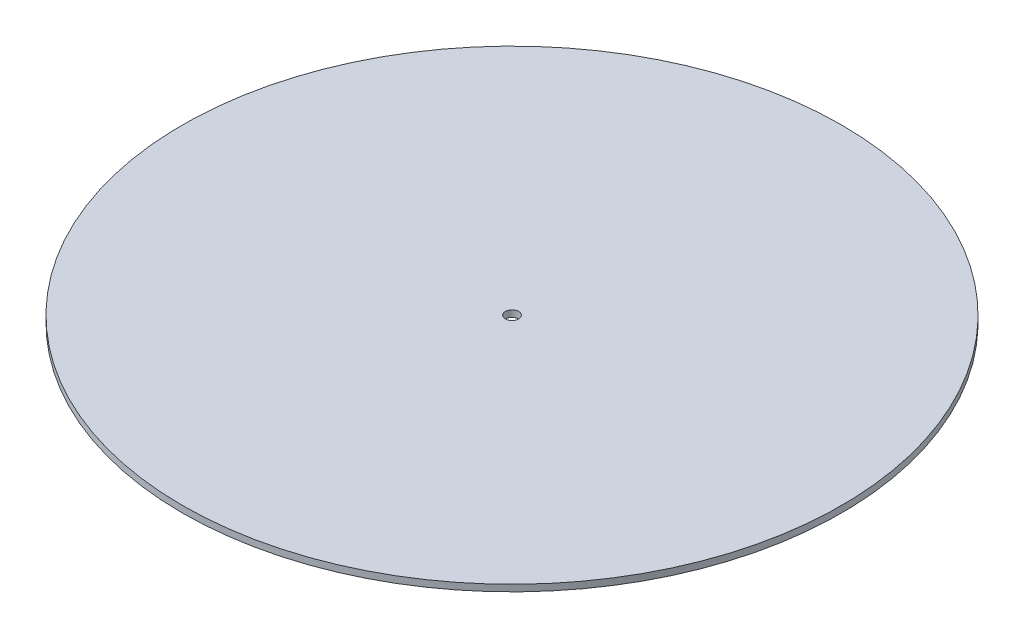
from build123d import *

# Parameters (mm, degrees)
SKETCH1_R      = 50
SKETCH1_R_2    = 1
EXTRUDE1_DEPTH = 1


with BuildPart() as part:
    # Sketch1 → Extrude1 (new body)
    with BuildSketch(Plane(origin=(0, 0, 0), x_dir=(1, 0, 0), z_dir=(0, 1, 0))):
        with Locations(Location((0, 0, 0), (0, 0, 270))):
            Circle(SKETCH1_R)
        with Locations(Location((0, 0, 0), (0, 0, 270))):
            Circle(SKETCH1_R_2, mode=Mode.SUBTRACT)
    extrude(amount=EXTRUDE1_DEPTH)


solid = part.part
